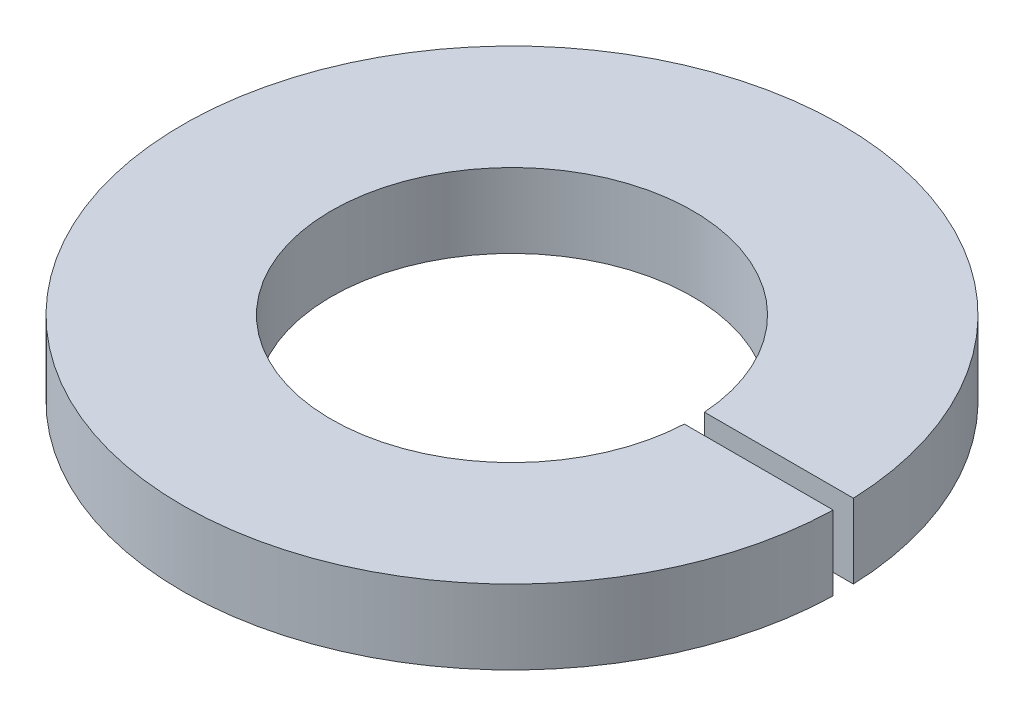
ISO-10303-21;
HEADER;
FILE_DESCRIPTION(('STEP AP214'),'2;1');
FILE_NAME('part.step','',(''),(''),'','','');
FILE_SCHEMA(('AUTOMOTIVE_DESIGN { 1 0 10303 214 1 1 1 1 }'));
ENDSEC;
DATA;
#1=APPLICATION_CONTEXT('core data for automotive mechanical design processes');
#2=APPLICATION_PROTOCOL_DEFINITION('international standard','automotive_design',2000,#1);
#3=PRODUCT_CONTEXT('',#1,'mechanical');
#4=PRODUCT('Part','Part','',(#3));
#5=PRODUCT_RELATED_PRODUCT_CATEGORY('part','',(#4));
#6=PRODUCT_DEFINITION_FORMATION('','',#4);
#7=PRODUCT_DEFINITION_CONTEXT('part definition',#1,'design');
#8=PRODUCT_DEFINITION('design','',#6,#7);
#9=PRODUCT_DEFINITION_SHAPE('','',#8);
#10=(LENGTH_UNIT() NAMED_UNIT(*) SI_UNIT(.MILLI.,.METRE.));
#11=(NAMED_UNIT(*) PLANE_ANGLE_UNIT() SI_UNIT($,.RADIAN.));
#12=(NAMED_UNIT(*) SI_UNIT($,.STERADIAN.) SOLID_ANGLE_UNIT());
#13=UNCERTAINTY_MEASURE_WITH_UNIT(LENGTH_MEASURE(1.E-05),#10,'distance_accuracy_value','');
#14=(GEOMETRIC_REPRESENTATION_CONTEXT(3) GLOBAL_UNCERTAINTY_ASSIGNED_CONTEXT((#13)) GLOBAL_UNIT_ASSIGNED_CONTEXT((#10,
#11,#12)) REPRESENTATION_CONTEXT('',''));
#15=CARTESIAN_POINT('',(0.,0.,0.));
#16=DIRECTION('',(0.,0.,1.));
#17=DIRECTION('',(1.,0.,0.));
#18=AXIS2_PLACEMENT_3D('',#15,#16,#17);
#19=CARTESIAN_POINT('',(0.,0.7,0.));
#20=DIRECTION('',(0.,-1.,0.));
#21=DIRECTION('',(0.,0.,-1.));
#22=AXIS2_PLACEMENT_3D('',#19,#20,#21);
#23=CYLINDRICAL_SURFACE('',#22,3.1);
#24=CARTESIAN_POINT('',(0.,0.7,0.));
#25=DIRECTION('',(0.,1.,0.));
#26=DIRECTION('',(0.,0.,1.));
#27=AXIS2_PLACEMENT_3D('',#24,#25,#26);
#28=CIRCLE('',#27,3.1);
#29=CARTESIAN_POINT('',(3.09790765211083,0.7,-0.113877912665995));
#30=VERTEX_POINT('',#29);
#31=CARTESIAN_POINT('',(3.09902848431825,0.7,0.0776044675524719));
#32=VERTEX_POINT('',#31);
#33=EDGE_CURVE('E38',#30,#32,#28,.T.);
#34=ORIENTED_EDGE('',*,*,#33,.F.);
#35=DIRECTION('',(0.,-1.,0.));
#36=VECTOR('',#35,1.);
#37=CARTESIAN_POINT('',(3.09790765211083,0.7,-0.113877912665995));
#38=LINE('',#37,#36);
#39=CARTESIAN_POINT('',(3.09790765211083,0.,-0.113877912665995));
#40=VERTEX_POINT('',#39);
#41=EDGE_CURVE('E89',#30,#40,#38,.T.);
#42=ORIENTED_EDGE('',*,*,#41,.T.);
#43=CARTESIAN_POINT('',(0.,0.,0.));
#44=DIRECTION('',(0.,1.,0.));
#45=DIRECTION('',(0.,0.,1.));
#46=AXIS2_PLACEMENT_3D('',#43,#44,#45);
#47=CIRCLE('',#46,3.1);
#48=CARTESIAN_POINT('',(3.09902848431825,0.,0.0776044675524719));
#49=VERTEX_POINT('',#48);
#50=EDGE_CURVE('E84',#40,#49,#47,.T.);
#51=ORIENTED_EDGE('',*,*,#50,.T.);
#52=DIRECTION('',(0.,-1.,0.));
#53=VECTOR('',#52,1.);
#54=CARTESIAN_POINT('',(3.09902848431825,0.7,0.0776044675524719));
#55=LINE('',#54,#53);
#56=EDGE_CURVE('E76',#49,#32,#55,.F.);
#57=ORIENTED_EDGE('',*,*,#56,.T.);
#58=EDGE_LOOP('',(#34,#42,#51,#57));
#59=FACE_BOUND('',#58,.T.);
#60=ADVANCED_FACE('F31',(#59),#23,.T.);
#61=CARTESIAN_POINT('',(0.,0.7,0.));
#62=DIRECTION('',(0.,1.,0.));
#63=DIRECTION('',(0.,0.,1.));
#64=AXIS2_PLACEMENT_3D('',#61,#62,#63);
#65=PLANE('',#64);
#66=DIRECTION('',(-1.,0.,0.));
#67=VECTOR('',#66,1.);
#68=CARTESIAN_POINT('',(1.69618154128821,0.7,-0.113877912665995));
#69=LINE('',#68,#67);
#70=CARTESIAN_POINT('',(1.69618154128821,0.7,-0.113877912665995));
#71=VERTEX_POINT('',#70);
#72=EDGE_CURVE('E45',#30,#71,#69,.T.);
#73=ORIENTED_EDGE('',*,*,#72,.F.);
#74=ORIENTED_EDGE('',*,*,#33,.T.);
#75=DIRECTION('',(1.,0.,0.));
#76=VECTOR('',#75,1.);
#77=CARTESIAN_POINT('',(1.69618154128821,0.7,0.0776044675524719));
#78=LINE('',#77,#76);
#79=CARTESIAN_POINT('',(1.69822776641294,0.7,0.0776044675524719));
#80=VERTEX_POINT('',#79);
#81=EDGE_CURVE('E99',#80,#32,#78,.T.);
#82=ORIENTED_EDGE('',*,*,#81,.F.);
#83=CARTESIAN_POINT('',(0.,0.7,0.));
#84=DIRECTION('',(0.,1.,0.));
#85=DIRECTION('',(0.,0.,1.));
#86=AXIS2_PLACEMENT_3D('',#83,#84,#85);
#87=CIRCLE('',#86,1.7);
#88=EDGE_CURVE('E87',#71,#80,#87,.T.);
#89=ORIENTED_EDGE('',*,*,#88,.F.);
#90=EDGE_LOOP('',(#73,#74,#82,#89));
#91=FACE_BOUND('',#90,.T.);
#92=ADVANCED_FACE('F98',(#91),#65,.T.);
#93=CARTESIAN_POINT('',(0.,0.,0.));
#94=DIRECTION('',(0.,1.,0.));
#95=DIRECTION('',(0.,0.,1.));
#96=AXIS2_PLACEMENT_3D('',#93,#94,#95);
#97=PLANE('',#96);
#98=ORIENTED_EDGE('',*,*,#50,.F.);
#99=DIRECTION('',(-1.,0.,0.));
#100=VECTOR('',#99,1.);
#101=CARTESIAN_POINT('',(1.69618154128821,0.,-0.113877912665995));
#102=LINE('',#101,#100);
#103=CARTESIAN_POINT('',(1.69618154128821,0.,-0.113877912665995));
#104=VERTEX_POINT('',#103);
#105=EDGE_CURVE('E70',#40,#104,#102,.T.);
#106=ORIENTED_EDGE('',*,*,#105,.T.);
#107=CARTESIAN_POINT('',(0.,0.,0.));
#108=DIRECTION('',(0.,1.,0.));
#109=DIRECTION('',(0.,0.,1.));
#110=AXIS2_PLACEMENT_3D('',#107,#108,#109);
#111=CIRCLE('',#110,1.7);
#112=CARTESIAN_POINT('',(1.69822776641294,0.,0.0776044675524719));
#113=VERTEX_POINT('',#112);
#114=EDGE_CURVE('E82',#104,#113,#111,.T.);
#115=ORIENTED_EDGE('',*,*,#114,.T.);
#116=DIRECTION('',(1.,0.,0.));
#117=VECTOR('',#116,1.);
#118=CARTESIAN_POINT('',(1.69618154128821,0.,0.0776044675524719));
#119=LINE('',#118,#117);
#120=EDGE_CURVE('E53',#113,#49,#119,.T.);
#121=ORIENTED_EDGE('',*,*,#120,.T.);
#122=EDGE_LOOP('',(#98,#106,#115,#121));
#123=FACE_BOUND('',#122,.T.);
#124=ADVANCED_FACE('F81',(#123),#97,.F.);
#125=CARTESIAN_POINT('',(0.,0.,0.));
#126=DIRECTION('',(0.,1.,0.));
#127=DIRECTION('',(0.,0.,1.));
#128=AXIS2_PLACEMENT_3D('',#125,#126,#127);
#129=CYLINDRICAL_SURFACE('',#128,1.7);
#130=ORIENTED_EDGE('',*,*,#114,.F.);
#131=DIRECTION('',(0.,1.,0.));
#132=VECTOR('',#131,1.);
#133=CARTESIAN_POINT('',(1.69618154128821,0.,-0.113877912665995));
#134=LINE('',#133,#132);
#135=EDGE_CURVE('E67',#104,#71,#134,.T.);
#136=ORIENTED_EDGE('',*,*,#135,.T.);
#137=ORIENTED_EDGE('',*,*,#88,.T.);
#138=DIRECTION('',(0.,1.,0.));
#139=VECTOR('',#138,1.);
#140=CARTESIAN_POINT('',(1.69822776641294,0.,0.0776044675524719));
#141=LINE('',#140,#139);
#142=EDGE_CURVE('E11',#80,#113,#141,.F.);
#143=ORIENTED_EDGE('',*,*,#142,.T.);
#144=EDGE_LOOP('',(#130,#136,#137,#143));
#145=FACE_BOUND('',#144,.T.);
#146=ADVANCED_FACE('F86',(#145),#129,.F.);
#147=CARTESIAN_POINT('',(1.69618154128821,0.,0.0776044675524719));
#148=DIRECTION('',(0.,0.,1.));
#149=DIRECTION('',(1.,0.,0.));
#150=AXIS2_PLACEMENT_3D('',#147,#148,#149);
#151=PLANE('',#150);
#152=ORIENTED_EDGE('',*,*,#120,.F.);
#153=ORIENTED_EDGE('',*,*,#142,.F.);
#154=ORIENTED_EDGE('',*,*,#81,.T.);
#155=ORIENTED_EDGE('',*,*,#56,.F.);
#156=EDGE_LOOP('',(#152,#153,#154,#155));
#157=FACE_BOUND('',#156,.T.);
#158=ADVANCED_FACE('F105',(#157),#151,.F.);
#159=CARTESIAN_POINT('',(1.69618154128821,0.,-0.113877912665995));
#160=DIRECTION('',(0.,0.,-1.));
#161=DIRECTION('',(-1.,0.,0.));
#162=AXIS2_PLACEMENT_3D('',#159,#160,#161);
#163=PLANE('',#162);
#164=ORIENTED_EDGE('',*,*,#72,.T.);
#165=ORIENTED_EDGE('',*,*,#135,.F.);
#166=ORIENTED_EDGE('',*,*,#105,.F.);
#167=ORIENTED_EDGE('',*,*,#41,.F.);
#168=EDGE_LOOP('',(#164,#165,#166,#167));
#169=FACE_BOUND('',#168,.T.);
#170=ADVANCED_FACE('F69',(#169),#163,.F.);
#171=CLOSED_SHELL('',(#60,#92,#124,#146,#158,#170));
#172=MANIFOLD_SOLID_BREP('B2',#171);
#173=ADVANCED_BREP_SHAPE_REPRESENTATION('',(#18,#172),#14);
#174=SHAPE_DEFINITION_REPRESENTATION(#9,#173);
ENDSEC;
END-ISO-10303-21;
